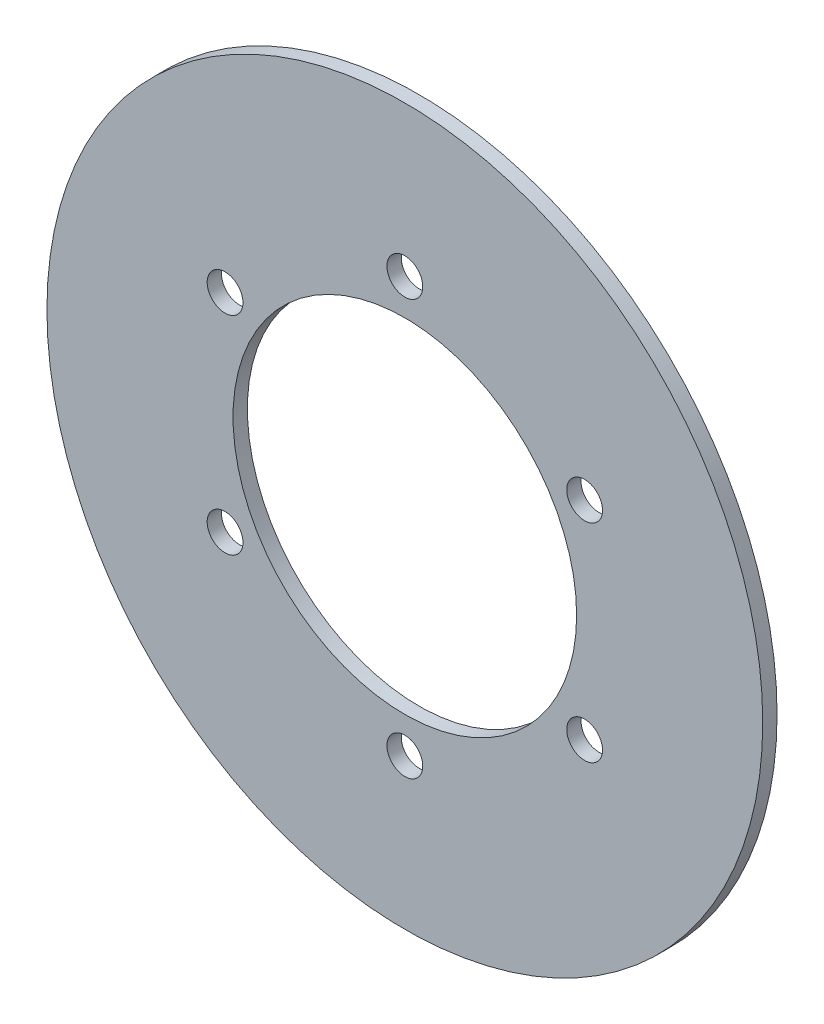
from build123d import *

# Parameters (mm, degrees)
SKETCH1_R           = 50
SKETCH1_R_2         = 24
SKETCH1_R_3         = 2.5
BOSS_EXTRUDE1_DEPTH = 2


with BuildPart() as part:
    # Sketch1 → Boss-Extrude1 (new body)
    with BuildSketch(Plane.XY):
        Circle(SKETCH1_R)
        Circle(SKETCH1_R_2, mode=Mode.SUBTRACT)
        with Locations((0, 29)):
            Circle(SKETCH1_R_3, mode=Mode.SUBTRACT)
        with Locations((25.11473671, 14.5)):
            Circle(SKETCH1_R_3, mode=Mode.SUBTRACT)
        with Locations((25.11473671, -14.5)):
            Circle(SKETCH1_R_3, mode=Mode.SUBTRACT)
        with Locations((0, -29)):
            Circle(SKETCH1_R_3, mode=Mode.SUBTRACT)
        with Locations((-25.11473671, -14.5)):
            Circle(SKETCH1_R_3, mode=Mode.SUBTRACT)
        with Locations((-25.11473671, 14.5)):
            Circle(SKETCH1_R_3, mode=Mode.SUBTRACT)
    extrude(amount=BOSS_EXTRUDE1_DEPTH)


solid = part.part
